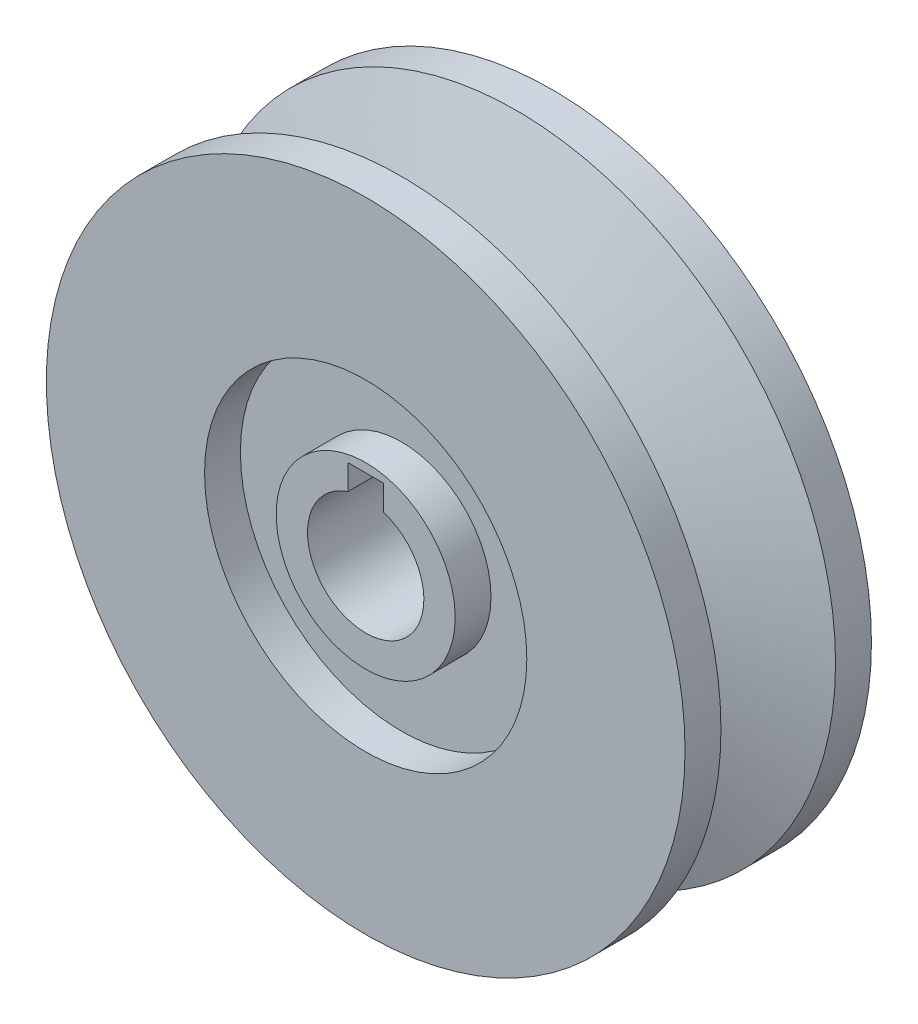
from build123d import *

# Parameters (mm, degrees)
CUT_EXTRUDE_1_DEPTH = 55.582201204
SKETCH_3_R          = 18
SKETCH_3_R_2        = 10
CUT_EXTRUDE_2_DEPTH = 4
CUT_EXTRUDE_START   = -4
SKETCH_4_R          = 18
SKETCH_4_R_2        = 10
CUT_EXTRUDE_3_DEPTH = 4


with BuildPart() as part:
    # Sketch1 → A Pulley_ 65.0000mm P.D (revolve)
    with BuildSketch(Plane(origin=(0, 0, 0), x_dir=(0, 0, -1), z_dir=(1, 0, 0)), mode=Mode.PRIVATE) as a_pulley_65_0000mm_p_d_sk:
        Polygon((10.413999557, 0), (10.413999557, 35.674999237), (6.400800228, 35.674999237), (2.115298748, 23.228999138), (-2.115298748, 23.228999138), (-6.400800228, 35.674999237), (-10.413999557, 35.674999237), (-10.413999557, 0), align=None)
    revolve(a_pulley_65_0000mm_p_d_sk.sketch.rotate(Axis((0, 0, 20.827999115), (0, 0, -1)), 90), axis=Axis((0, 0, 20.827999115), (0, 0, -1)))

    # Sketch 2 → Cut-Extrude 1 (cut, through all)
    with BuildSketch(Plane(origin=(0, 0, -10.413999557), x_dir=(-1, 0, 0), z_dir=(0, 0, -1))):
        with BuildLine():
            Line((-2, 9), (-2, 6.184658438))
            ThreePointArc((-2, 6.184658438), (0, -6.5), (2, 6.184658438))
            Line((2, 6.184658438), (2, 9))
            Line((2, 9), (-2, 9))
        make_face()
    extrude(amount=-CUT_EXTRUDE_1_DEPTH, mode=Mode.SUBTRACT)

    # Sketch 3 → Cut-Extrude 2 (cut)
    with BuildSketch(Plane(origin=(0, 0, -10.413999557), x_dir=(-1, 0, 0), z_dir=(0, 0, -1))):
        Circle(SKETCH_3_R)
        Circle(SKETCH_3_R_2, mode=Mode.SUBTRACT)
    extrude(amount=-CUT_EXTRUDE_2_DEPTH, mode=Mode.SUBTRACT)

    # Sketch 4 → Cut-Extrude 3 (cut)
    with BuildSketch(Plane.XY.offset(10.413999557).offset(CUT_EXTRUDE_START)):
        with Locations(Location((0, 0, 0), (0, 0, 180))):
            Circle(SKETCH_4_R)
        with Locations(Location((0, 0, 0), (0, 0, 180))):
            Circle(SKETCH_4_R_2, mode=Mode.SUBTRACT)
    extrude(amount=CUT_EXTRUDE_3_DEPTH, mode=Mode.SUBTRACT)


solid = part.part
